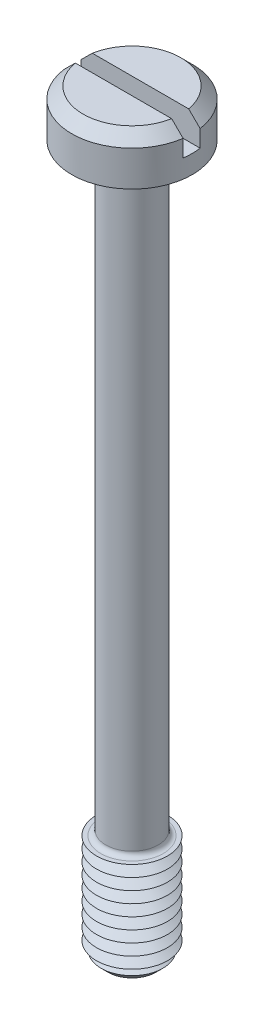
ISO-10303-21;
HEADER;
FILE_DESCRIPTION(('STEP AP214'),'2;1');
FILE_NAME('part.step','',(''),(''),'','','');
FILE_SCHEMA(('AUTOMOTIVE_DESIGN { 1 0 10303 214 1 1 1 1 }'));
ENDSEC;
DATA;
#1=APPLICATION_CONTEXT('core data for automotive mechanical design processes');
#2=APPLICATION_PROTOCOL_DEFINITION('international standard','automotive_design',2000,#1);
#3=PRODUCT_CONTEXT('',#1,'mechanical');
#4=PRODUCT('Part','Part','',(#3));
#5=PRODUCT_RELATED_PRODUCT_CATEGORY('part','',(#4));
#6=PRODUCT_DEFINITION_FORMATION('','',#4);
#7=PRODUCT_DEFINITION_CONTEXT('part definition',#1,'design');
#8=PRODUCT_DEFINITION('design','',#6,#7);
#9=PRODUCT_DEFINITION_SHAPE('','',#8);
#10=(LENGTH_UNIT() NAMED_UNIT(*) SI_UNIT(.MILLI.,.METRE.));
#11=(NAMED_UNIT(*) PLANE_ANGLE_UNIT() SI_UNIT($,.RADIAN.));
#12=(NAMED_UNIT(*) SI_UNIT($,.STERADIAN.) SOLID_ANGLE_UNIT());
#13=UNCERTAINTY_MEASURE_WITH_UNIT(LENGTH_MEASURE(1.E-05),#10,'distance_accuracy_value','');
#14=(GEOMETRIC_REPRESENTATION_CONTEXT(3) GLOBAL_UNCERTAINTY_ASSIGNED_CONTEXT((#13)) GLOBAL_UNIT_ASSIGNED_CONTEXT((#10,
#11,#12)) REPRESENTATION_CONTEXT('',''));
#15=CARTESIAN_POINT('',(0.,0.,0.));
#16=DIRECTION('',(0.,0.,1.));
#17=DIRECTION('',(1.,0.,0.));
#18=AXIS2_PLACEMENT_3D('',#15,#16,#17);
#19=CARTESIAN_POINT('',(0.,3.3,0.));
#20=DIRECTION('',(0.,1.,0.));
#21=DIRECTION('',(0.,0.,1.));
#22=AXIS2_PLACEMENT_3D('',#19,#20,#21);
#23=PLANE('',#22);
#24=DIRECTION('',(-1.,0.,0.));
#25=VECTOR('',#24,1.);
#26=CARTESIAN_POINT('',(4.25,3.3,-0.6));
#27=LINE('',#26,#25);
#28=CARTESIAN_POINT('',(3.39742549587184,3.3,-0.6));
#29=VERTEX_POINT('',#28);
#30=CARTESIAN_POINT('',(-3.39742549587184,3.3,-0.6));
#31=VERTEX_POINT('',#30);
#32=EDGE_CURVE('E110',#29,#31,#27,.T.);
#33=ORIENTED_EDGE('',*,*,#32,.F.);
#34=CARTESIAN_POINT('',(0.,3.3,0.));
#35=DIRECTION('',(0.,1.,0.));
#36=DIRECTION('',(0.,0.,1.));
#37=AXIS2_PLACEMENT_3D('',#34,#35,#36);
#38=CIRCLE('',#37,3.45);
#39=EDGE_CURVE('E113',#29,#31,#38,.T.);
#40=ORIENTED_EDGE('',*,*,#39,.T.);
#41=EDGE_LOOP('',(#33,#40));
#42=FACE_BOUND('',#41,.T.);
#43=ADVANCED_FACE('F39',(#42),#23,.T.);
#44=CARTESIAN_POINT('',(0.,3.3,0.));
#45=DIRECTION('',(0.,-1.,0.));
#46=DIRECTION('',(0.,0.,-1.));
#47=AXIS2_PLACEMENT_3D('',#44,#45,#46);
#48=CONICAL_SURFACE('',#47,3.45,0.785398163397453);
#49=CARTESIAN_POINT('',(9.3535140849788,-2.62273843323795,-0.6));
#50=CARTESIAN_POINT('',(9.03263557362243,-2.30252317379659,-0.6));
#51=CARTESIAN_POINT('',(8.71172811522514,-1.9823369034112,-0.6));
#52=CARTESIAN_POINT('',(8.06981262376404,-1.34205341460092,-0.6));
#53=CARTESIAN_POINT('',(7.74880458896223,-1.02195619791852,-0.6));
#54=CARTESIAN_POINT('',(7.10652460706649,-0.38176164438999,-0.6));
#55=CARTESIAN_POINT('',(6.78525260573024,-0.0616643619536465,-0.6));
#56=CARTESIAN_POINT('',(6.14251393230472,0.578323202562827,-0.6));
#57=CARTESIAN_POINT('',(5.8210472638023,0.898213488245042,-0.6));
#58=CARTESIAN_POINT('',(5.17196209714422,1.54347500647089,-0.6));
#59=CARTESIAN_POINT('',(4.84433778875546,1.86884039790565,-0.6));
#60=CARTESIAN_POINT('',(4.3524444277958,2.35644593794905,-0.6));
#61=CARTESIAN_POINT('',(4.18839924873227,2.51891187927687,-0.6));
#62=CARTESIAN_POINT('',(3.8600960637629,2.84362679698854,-0.6));
#63=CARTESIAN_POINT('',(3.69583805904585,3.00587577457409,-0.6));
#64=CARTESIAN_POINT('',(3.36705354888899,3.33001661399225,-0.6));
#65=CARTESIAN_POINT('',(3.20252712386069,3.49190855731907,-0.6));
#66=CARTESIAN_POINT('',(2.87298689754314,3.81520272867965,-0.6));
#67=CARTESIAN_POINT('',(2.70797308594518,3.97660494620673,-0.6));
#68=CARTESIAN_POINT('',(2.37716903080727,4.29858210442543,-0.6));
#69=CARTESIAN_POINT('',(2.2113788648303,4.45915712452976,-0.6));
#70=CARTESIAN_POINT('',(1.96157219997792,4.69884609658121,-0.6));
#71=CARTESIAN_POINT('',(1.8781178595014,4.77854546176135,-0.6));
#72=CARTESIAN_POINT('',(1.71066064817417,4.93736532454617,-0.6));
#73=CARTESIAN_POINT('',(1.6266577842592,5.01648582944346,-0.6));
#74=CARTESIAN_POINT('',(1.49655488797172,5.13773269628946,-0.6));
#75=CARTESIAN_POINT('',(1.45074972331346,5.1801752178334,-0.6));
#76=CARTESIAN_POINT('',(1.3588211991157,5.26471614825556,-0.6));
#77=CARTESIAN_POINT('',(1.31269783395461,5.30681455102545,-0.6));
#78=CARTESIAN_POINT('',(1.22008852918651,5.39050695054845,-0.6));
#79=CARTESIAN_POINT('',(1.17360305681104,5.4321014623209,-0.6));
#80=CARTESIAN_POINT('',(1.08007401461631,5.51465347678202,-0.6));
#81=CARTESIAN_POINT('',(1.03303046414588,5.55561100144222,-0.6));
#82=CARTESIAN_POINT('',(0.919047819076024,5.65299331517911,-0.6));
#83=CARTESIAN_POINT('',(0.851738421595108,5.70899242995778,-0.6));
#84=CARTESIAN_POINT('',(0.748806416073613,5.79068526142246,-0.6));
#85=CARTESIAN_POINT('',(0.714125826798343,5.81756213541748,-0.6));
#86=CARTESIAN_POINT('',(0.643915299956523,5.87018079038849,-0.6));
#87=CARTESIAN_POINT('',(0.608385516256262,5.89592277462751,-0.6));
#88=CARTESIAN_POINT('',(0.545162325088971,5.93955652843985,-0.6));
#89=CARTESIAN_POINT('',(0.517718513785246,5.95780799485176,-0.6));
#90=CARTESIAN_POINT('',(0.462025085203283,5.99303174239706,-0.6));
#91=CARTESIAN_POINT('',(0.433775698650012,6.01000438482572,-0.6));
#92=CARTESIAN_POINT('',(0.3763419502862,6.0421383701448,-0.6));
#93=CARTESIAN_POINT('',(0.347160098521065,6.05730412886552,-0.6));
#94=CARTESIAN_POINT('',(0.287642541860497,6.08513394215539,-0.6));
#95=CARTESIAN_POINT('',(0.25730803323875,6.09780051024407,-0.6));
#96=CARTESIAN_POINT('',(0.190863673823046,6.12124627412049,-0.6));
#97=CARTESIAN_POINT('',(0.154554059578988,6.13148571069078,-0.6));
#98=CARTESIAN_POINT('',(0.0807909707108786,6.14565404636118,-0.6));
#99=CARTESIAN_POINT('',(0.0433423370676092,6.14960664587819,-0.6));
#100=CARTESIAN_POINT('',(-0.03179874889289,6.15033783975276,-0.6));
#101=CARTESIAN_POINT('',(-0.0694915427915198,6.14708428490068,-0.6));
#102=CARTESIAN_POINT('',(-0.143790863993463,6.13410921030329,-0.6));
#103=CARTESIAN_POINT('',(-0.180393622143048,6.12436747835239,-0.6));
#104=CARTESIAN_POINT('',(-0.254098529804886,6.09939647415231,-0.6));
#105=CARTESIAN_POINT('',(-0.291094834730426,6.08386859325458,-0.6));
#106=CARTESIAN_POINT('',(-0.363408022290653,6.04924663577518,-0.6));
#107=CARTESIAN_POINT('',(-0.398721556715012,6.03014579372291,-0.6));
#108=CARTESIAN_POINT('',(-0.468234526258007,5.98944452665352,-0.6));
#109=CARTESIAN_POINT('',(-0.502422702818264,5.96782521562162,-0.6));
#110=CARTESIAN_POINT('',(-0.569689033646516,5.92300618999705,-0.6));
#111=CARTESIAN_POINT('',(-0.602768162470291,5.89980792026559,-0.6));
#112=CARTESIAN_POINT('',(-0.67114821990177,5.85008963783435,-0.6));
#113=CARTESIAN_POINT('',(-0.706369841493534,5.82346130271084,-0.6));
#114=CARTESIAN_POINT('',(-0.776087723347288,5.76926828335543,-0.6));
#115=CARTESIAN_POINT('',(-0.810583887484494,5.74170347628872,-0.6));
#116=CARTESIAN_POINT('',(-0.913286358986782,5.65798278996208,-0.6));
#117=CARTESIAN_POINT('',(-0.980673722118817,5.60082541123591,-0.6));
#118=CARTESIAN_POINT('',(-1.11424616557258,5.4849067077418,-0.6));
#119=CARTESIAN_POINT('',(-1.18042891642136,5.4261427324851,-0.6));
#120=CARTESIAN_POINT('',(-1.31191262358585,5.30767463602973,-0.6));
#121=CARTESIAN_POINT('',(-1.37721382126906,5.24797078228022,-0.6));
#122=CARTESIAN_POINT('',(-1.5070108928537,5.12812906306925,-0.6));
#123=CARTESIAN_POINT('',(-1.57150872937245,5.06799331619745,-0.6));
#124=CARTESIAN_POINT('',(-1.7000913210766,4.94727328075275,-0.6));
#125=CARTESIAN_POINT('',(-1.76417604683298,4.88668896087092,-0.6));
#126=CARTESIAN_POINT('',(-1.95584105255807,4.70458824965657,-0.6));
#127=CARTESIAN_POINT('',(-2.08296922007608,4.58259645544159,-0.6));
#128=CARTESIAN_POINT('',(-2.33599178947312,4.3384062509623,-0.6));
#129=CARTESIAN_POINT('',(-2.46188913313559,4.21621087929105,-0.6));
#130=CARTESIAN_POINT('',(-2.71323511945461,3.97135925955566,-0.6));
#131=CARTESIAN_POINT('',(-2.8386837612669,3.84870301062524,-0.6));
#132=CARTESIAN_POINT('',(-3.21459106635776,3.48027743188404,-0.6));
#133=CARTESIAN_POINT('',(-3.46460626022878,3.23405597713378,-0.6));
#134=CARTESIAN_POINT('',(-3.9641379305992,2.7409031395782,-0.6));
#135=CARTESIAN_POINT('',(-4.21365415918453,2.49397150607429,-0.6));
#136=CARTESIAN_POINT('',(-4.71232475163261,1.99974737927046,-0.6));
#137=CARTESIAN_POINT('',(-4.96147911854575,1.75245488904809,-0.6));
#138=CARTESIAN_POINT('',(-5.45958725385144,1.25761544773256,-0.6));
#139=CARTESIAN_POINT('',(-5.70854099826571,1.01006847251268,-0.6));
#140=CARTESIAN_POINT('',(-6.20629498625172,0.514819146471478,-0.6));
#141=CARTESIAN_POINT('',(-6.45509522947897,0.267116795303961,-0.6));
#142=CARTESIAN_POINT('',(-7.20128563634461,-0.476100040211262,-0.6));
#143=CARTESIAN_POINT('',(-7.69851620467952,-0.971774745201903,-0.6));
#144=CARTESIAN_POINT('',(-8.38865115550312,-1.66007026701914,-0.6));
#145=CARTESIAN_POINT('',(-8.58165346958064,-1.85259293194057,-0.6));
#146=CARTESIAN_POINT('',(-8.87112736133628,-2.14139225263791,-0.6));
#147=CARTESIAN_POINT('',(-8.96761014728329,-2.2376576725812,-0.6));
#148=CARTESIAN_POINT('',(-9.1605676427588,-2.43019387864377,-0.6));
#149=CARTESIAN_POINT('',(-9.25704235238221,-2.52646466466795,-0.6));
#150=CARTESIAN_POINT('',(-9.3535140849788,-2.62273843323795,-0.6));
#151=B_SPLINE_CURVE_WITH_KNOTS('',3,(#49,#50,#51,#52,#53,#54,#55,#56,#57,#58,#59,#60,#61,#62,
#63,#64,#65,#66,#67,#68,#69,#70,#71,#72,#73,#74,#75,#76,#77,#78,#79,#80,#81,#82,#83,#84,#85,#86,
#87,#88,#89,#90,#91,#92,#93,#94,#95,#96,#97,#98,#99,#100,#101,#102,#103,#104,#105,#106,#107,
#108,#109,#110,#111,#112,#113,#114,#115,#116,#117,#118,#119,#120,#121,#122,#123,#124,#125,#126,
#127,#128,#129,#130,#131,#132,#133,#134,#135,#136,#137,#138,#139,#140,#141,#142,#143,#144,#145,
#146,#147,#148,#149,#150),.UNSPECIFIED.,.F.,.F.,(4,2,2,2,2,2,2,2,2,2,2,2,2,2,2,2,2,2,2,2,2,2,2,
2,2,2,2,2,2,2,2,2,2,2,2,2,2,2,2,2,2,2,2,2,2,2,2,2,2,2,4),(0.,1.35996600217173,2.71995696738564,
4.08050889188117,5.44103646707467,6.82624457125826,7.51888721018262,8.21152599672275,
8.90398568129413,9.596460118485,10.288866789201,10.6350581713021,10.9812451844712,
11.1685812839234,11.3559207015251,11.5430489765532,11.7301707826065,11.9927784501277,
12.1243921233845,12.2559821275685,12.3548333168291,12.4536564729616,12.5522329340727,
12.6507097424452,12.763461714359,12.8757876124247,12.9886156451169,13.101796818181,
13.2218851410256,13.3422031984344,13.4634899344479,13.584667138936,13.7171086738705,
13.8495676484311,14.1146090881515,14.3801178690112,14.6455524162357,14.910099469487,
15.17466516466,15.7032346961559,16.2295761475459,16.7559185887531,17.8086237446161,
18.8617626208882,19.9148925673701,20.9681337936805,22.0213773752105,24.1276499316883,
24.9454725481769,25.354353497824,25.7632286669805),.UNSPECIFIED.);
#152=CARTESIAN_POINT('',(4.20743389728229,2.50000000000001,-0.6));
#153=VERTEX_POINT('',#152);
#154=EDGE_CURVE('E268',#153,#29,#151,.T.);
#155=ORIENTED_EDGE('',*,*,#154,.F.);
#156=CARTESIAN_POINT('',(0.,2.50000000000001,0.));
#157=DIRECTION('',(0.,1.,0.));
#158=DIRECTION('',(0.,0.,1.));
#159=AXIS2_PLACEMENT_3D('',#156,#157,#158);
#160=CIRCLE('',#159,4.25);
#161=CARTESIAN_POINT('',(-4.20743389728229,2.50000000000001,-0.6));
#162=VERTEX_POINT('',#161);
#163=EDGE_CURVE('E128',#162,#153,#160,.F.);
#164=ORIENTED_EDGE('',*,*,#163,.F.);
#165=EDGE_CURVE('E102',#31,#162,#151,.T.);
#166=ORIENTED_EDGE('',*,*,#165,.F.);
#167=ORIENTED_EDGE('',*,*,#39,.F.);
#168=EDGE_LOOP('',(#155,#164,#166,#167));
#169=FACE_BOUND('',#168,.T.);
#170=ADVANCED_FACE('F230',(#169),#48,.T.);
#171=CARTESIAN_POINT('',(0.,-50.,0.));
#172=DIRECTION('',(0.,1.,0.));
#173=DIRECTION('',(0.,0.,1.));
#174=AXIS2_PLACEMENT_3D('',#171,#172,#173);
#175=CYLINDRICAL_SURFACE('',#174,1.85);
#176=CARTESIAN_POINT('',(0.,-42.15,0.));
#177=DIRECTION('',(0.,-1.,0.));
#178=DIRECTION('',(0.,0.,-1.));
#179=AXIS2_PLACEMENT_3D('',#176,#177,#178);
#180=CIRCLE('',#179,1.85);
#181=CARTESIAN_POINT('',(0.,-42.15,-1.85));
#182=VERTEX_POINT('',#181);
#183=EDGE_CURVE('E123',#182,#182,#180,.F.);
#184=ORIENTED_EDGE('',*,*,#183,.T.);
#185=EDGE_LOOP('',(#184));
#186=FACE_BOUND('',#185,.T.);
#187=CARTESIAN_POINT('',(0.,-0.350000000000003,0.));
#188=DIRECTION('',(0.,1.,0.));
#189=DIRECTION('',(0.,0.,1.));
#190=AXIS2_PLACEMENT_3D('',#187,#188,#189);
#191=CIRCLE('',#190,1.85);
#192=CARTESIAN_POINT('',(0.,-0.350000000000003,1.85));
#193=VERTEX_POINT('',#192);
#194=EDGE_CURVE('E382',#193,#193,#191,.F.);
#195=ORIENTED_EDGE('',*,*,#194,.T.);
#196=EDGE_LOOP('',(#195));
#197=FACE_BOUND('',#196,.T.);
#198=ADVANCED_FACE('F226',(#186,#197),#175,.T.);
#199=CARTESIAN_POINT('',(0.,3.3,0.));
#200=DIRECTION('',(0.,-1.,0.));
#201=DIRECTION('',(0.,0.,-1.));
#202=AXIS2_PLACEMENT_3D('',#199,#200,#201);
#203=CYLINDRICAL_SURFACE('',#202,4.25);
#204=ORIENTED_EDGE('',*,*,#163,.T.);
#205=DIRECTION('',(0.,-1.,0.));
#206=VECTOR('',#205,1.);
#207=CARTESIAN_POINT('',(4.20743389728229,3.3,-0.6));
#208=LINE('',#207,#206);
#209=CARTESIAN_POINT('',(4.20743389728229,1.3,-0.6));
#210=VERTEX_POINT('',#209);
#211=EDGE_CURVE('E64',#153,#210,#208,.T.);
#212=ORIENTED_EDGE('',*,*,#211,.T.);
#213=CARTESIAN_POINT('',(0.,1.3,0.));
#214=DIRECTION('',(0.,1.,0.));
#215=DIRECTION('',(0.,0.,1.));
#216=AXIS2_PLACEMENT_3D('',#213,#214,#215);
#217=CIRCLE('',#216,4.25);
#218=CARTESIAN_POINT('',(4.20743389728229,1.3,0.6));
#219=VERTEX_POINT('',#218);
#220=EDGE_CURVE('E11',#219,#210,#217,.T.);
#221=ORIENTED_EDGE('',*,*,#220,.F.);
#222=DIRECTION('',(0.,-1.,0.));
#223=VECTOR('',#222,1.);
#224=CARTESIAN_POINT('',(4.20743389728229,3.3,0.6));
#225=LINE('',#224,#223);
#226=CARTESIAN_POINT('',(4.20743389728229,2.50000000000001,0.6));
#227=VERTEX_POINT('',#226);
#228=EDGE_CURVE('E283',#219,#227,#225,.F.);
#229=ORIENTED_EDGE('',*,*,#228,.T.);
#230=CARTESIAN_POINT('',(-4.20743389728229,2.50000000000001,0.6));
#231=VERTEX_POINT('',#230);
#232=EDGE_CURVE('E120',#227,#231,#160,.F.);
#233=ORIENTED_EDGE('',*,*,#232,.T.);
#234=DIRECTION('',(0.,-1.,0.));
#235=VECTOR('',#234,1.);
#236=CARTESIAN_POINT('',(-4.20743389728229,3.3,0.6));
#237=LINE('',#236,#235);
#238=CARTESIAN_POINT('',(-4.20743389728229,1.3,0.6));
#239=VERTEX_POINT('',#238);
#240=EDGE_CURVE('E96',#231,#239,#237,.T.);
#241=ORIENTED_EDGE('',*,*,#240,.T.);
#242=CARTESIAN_POINT('',(-4.20743389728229,1.3,-0.6));
#243=VERTEX_POINT('',#242);
#244=EDGE_CURVE('E44',#243,#239,#217,.T.);
#245=ORIENTED_EDGE('',*,*,#244,.F.);
#246=DIRECTION('',(0.,-1.,0.));
#247=VECTOR('',#246,1.);
#248=CARTESIAN_POINT('',(-4.20743389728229,3.3,-0.6));
#249=LINE('',#248,#247);
#250=EDGE_CURVE('E288',#243,#162,#249,.F.);
#251=ORIENTED_EDGE('',*,*,#250,.T.);
#252=EDGE_LOOP('',(#204,#212,#221,#229,#233,#241,#245,#251));
#253=FACE_BOUND('',#252,.T.);
#254=CARTESIAN_POINT('',(0.,0.,0.));
#255=DIRECTION('',(0.,1.,0.));
#256=DIRECTION('',(0.,0.,1.));
#257=AXIS2_PLACEMENT_3D('',#254,#255,#256);
#258=CIRCLE('',#257,4.25);
#259=CARTESIAN_POINT('',(0.,0.,4.25));
#260=VERTEX_POINT('',#259);
#261=EDGE_CURVE('E368',#260,#260,#258,.T.);
#262=ORIENTED_EDGE('',*,*,#261,.T.);
#263=EDGE_LOOP('',(#262));
#264=FACE_BOUND('',#263,.T.);
#265=ADVANCED_FACE('F229',(#253,#264),#203,.T.);
#266=DIRECTION('',(1.,0.,0.));
#267=VECTOR('',#266,1.);
#268=CARTESIAN_POINT('',(4.25,3.3,0.6));
#269=LINE('',#268,#267);
#270=CARTESIAN_POINT('',(-3.39742549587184,3.3,0.6));
#271=VERTEX_POINT('',#270);
#272=CARTESIAN_POINT('',(3.39742549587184,3.3,0.6));
#273=VERTEX_POINT('',#272);
#274=EDGE_CURVE('E56',#271,#273,#269,.T.);
#275=ORIENTED_EDGE('',*,*,#274,.F.);
#276=EDGE_CURVE('E108',#271,#273,#38,.T.);
#277=ORIENTED_EDGE('',*,*,#276,.T.);
#278=EDGE_LOOP('',(#275,#277));
#279=FACE_BOUND('',#278,.T.);
#280=ADVANCED_FACE('F107',(#279),#23,.T.);
#281=CARTESIAN_POINT('',(0.,0.,0.));
#282=DIRECTION('',(0.,1.,0.));
#283=DIRECTION('',(0.,0.,1.));
#284=AXIS2_PLACEMENT_3D('',#281,#282,#283);
#285=PLANE('',#284);
#286=CARTESIAN_POINT('',(0.,0.,0.));
#287=DIRECTION('',(0.,1.,0.));
#288=DIRECTION('',(0.,0.,1.));
#289=AXIS2_PLACEMENT_3D('',#286,#287,#288);
#290=CIRCLE('',#289,2.2);
#291=CARTESIAN_POINT('',(0.,0.,2.2));
#292=VERTEX_POINT('',#291);
#293=EDGE_CURVE('E114',#292,#292,#290,.T.);
#294=ORIENTED_EDGE('',*,*,#293,.T.);
#295=EDGE_LOOP('',(#294));
#296=FACE_BOUND('',#295,.T.);
#297=ORIENTED_EDGE('',*,*,#261,.F.);
#298=EDGE_LOOP('',(#297));
#299=FACE_BOUND('',#298,.T.);
#300=ADVANCED_FACE('F220',(#296,#299),#285,.F.);
#301=CARTESIAN_POINT('',(0.,-42.5,0.));
#302=DIRECTION('',(0.,-1.,0.));
#303=DIRECTION('',(0.,0.,-1.));
#304=AXIS2_PLACEMENT_3D('',#301,#302,#303);
#305=PLANE('',#304);
#306=CARTESIAN_POINT('',(0.,-42.5,0.));
#307=DIRECTION('',(0.,-1.,0.));
#308=DIRECTION('',(0.,0.,-1.));
#309=AXIS2_PLACEMENT_3D('',#306,#307,#308);
#310=CIRCLE('',#309,2.2);
#311=CARTESIAN_POINT('',(0.,-42.5,-2.2));
#312=VERTEX_POINT('',#311);
#313=EDGE_CURVE('E375',#312,#312,#310,.T.);
#314=ORIENTED_EDGE('',*,*,#313,.T.);
#315=EDGE_LOOP('',(#314));
#316=FACE_BOUND('',#315,.T.);
#317=CARTESIAN_POINT('',(0.,-42.5,0.));
#318=DIRECTION('',(0.,1.,0.));
#319=DIRECTION('',(0.,0.,1.));
#320=AXIS2_PLACEMENT_3D('',#317,#318,#319);
#321=CIRCLE('',#320,2.5);
#322=CARTESIAN_POINT('',(0.,-42.5,2.5));
#323=VERTEX_POINT('',#322);
#324=EDGE_CURVE('E365',#323,#323,#321,.T.);
#325=ORIENTED_EDGE('',*,*,#324,.T.);
#326=EDGE_LOOP('',(#325));
#327=FACE_BOUND('',#326,.T.);
#328=ADVANCED_FACE('F216',(#316,#327),#305,.F.);
#329=CARTESIAN_POINT('',(0.,-42.9,0.));
#330=DIRECTION('',(0.,1.,0.));
#331=DIRECTION('',(0.,0.,1.));
#332=AXIS2_PLACEMENT_3D('',#329,#330,#331);
#333=CONICAL_SURFACE('',#332,1.80717967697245,1.04719755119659);
#334=ORIENTED_EDGE('',*,*,#324,.F.);
#335=EDGE_LOOP('',(#334));
#336=FACE_BOUND('',#335,.T.);
#337=CARTESIAN_POINT('',(0.,-42.9,0.));
#338=DIRECTION('',(0.,1.,0.));
#339=DIRECTION('',(0.,0.,1.));
#340=AXIS2_PLACEMENT_3D('',#337,#338,#339);
#341=CIRCLE('',#340,1.80717967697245);
#342=CARTESIAN_POINT('',(0.,-42.9,1.80717967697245));
#343=VERTEX_POINT('',#342);
#344=EDGE_CURVE('E361',#343,#343,#341,.T.);
#345=ORIENTED_EDGE('',*,*,#344,.T.);
#346=EDGE_LOOP('',(#345));
#347=FACE_BOUND('',#346,.T.);
#348=ADVANCED_FACE('F212',(#336,#347),#333,.T.);
#349=CARTESIAN_POINT('',(0.,-43.3,0.));
#350=DIRECTION('',(0.,-1.,0.));
#351=DIRECTION('',(0.,0.,-1.));
#352=AXIS2_PLACEMENT_3D('',#349,#350,#351);
#353=CONICAL_SURFACE('',#352,2.5,1.0471975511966);
#354=ORIENTED_EDGE('',*,*,#344,.F.);
#355=EDGE_LOOP('',(#354));
#356=FACE_BOUND('',#355,.T.);
#357=CARTESIAN_POINT('',(0.,-43.3,0.));
#358=DIRECTION('',(0.,1.,0.));
#359=DIRECTION('',(0.,0.,1.));
#360=AXIS2_PLACEMENT_3D('',#357,#358,#359);
#361=CIRCLE('',#360,2.5);
#362=CARTESIAN_POINT('',(0.,-43.3,2.5));
#363=VERTEX_POINT('',#362);
#364=EDGE_CURVE('E357',#363,#363,#361,.T.);
#365=ORIENTED_EDGE('',*,*,#364,.T.);
#366=EDGE_LOOP('',(#365));
#367=FACE_BOUND('',#366,.T.);
#368=ADVANCED_FACE('F208',(#356,#367),#353,.T.);
#369=CARTESIAN_POINT('',(0.,-43.7,0.));
#370=DIRECTION('',(0.,1.,0.));
#371=DIRECTION('',(0.,0.,1.));
#372=AXIS2_PLACEMENT_3D('',#369,#370,#371);
#373=CONICAL_SURFACE('',#372,1.80717967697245,1.04719755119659);
#374=ORIENTED_EDGE('',*,*,#364,.F.);
#375=EDGE_LOOP('',(#374));
#376=FACE_BOUND('',#375,.T.);
#377=CARTESIAN_POINT('',(0.,-43.7,0.));
#378=DIRECTION('',(0.,1.,0.));
#379=DIRECTION('',(0.,0.,1.));
#380=AXIS2_PLACEMENT_3D('',#377,#378,#379);
#381=CIRCLE('',#380,1.80717967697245);
#382=CARTESIAN_POINT('',(0.,-43.7,1.80717967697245));
#383=VERTEX_POINT('',#382);
#384=EDGE_CURVE('E353',#383,#383,#381,.T.);
#385=ORIENTED_EDGE('',*,*,#384,.T.);
#386=EDGE_LOOP('',(#385));
#387=FACE_BOUND('',#386,.T.);
#388=ADVANCED_FACE('F204',(#376,#387),#373,.T.);
#389=CARTESIAN_POINT('',(0.,-44.1,0.));
#390=DIRECTION('',(0.,-1.,0.));
#391=DIRECTION('',(0.,0.,-1.));
#392=AXIS2_PLACEMENT_3D('',#389,#390,#391);
#393=CONICAL_SURFACE('',#392,2.5,1.0471975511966);
#394=ORIENTED_EDGE('',*,*,#384,.F.);
#395=EDGE_LOOP('',(#394));
#396=FACE_BOUND('',#395,.T.);
#397=CARTESIAN_POINT('',(0.,-44.1,0.));
#398=DIRECTION('',(0.,1.,0.));
#399=DIRECTION('',(0.,0.,1.));
#400=AXIS2_PLACEMENT_3D('',#397,#398,#399);
#401=CIRCLE('',#400,2.5);
#402=CARTESIAN_POINT('',(0.,-44.1,2.5));
#403=VERTEX_POINT('',#402);
#404=EDGE_CURVE('E350',#403,#403,#401,.T.);
#405=ORIENTED_EDGE('',*,*,#404,.T.);
#406=EDGE_LOOP('',(#405));
#407=FACE_BOUND('',#406,.T.);
#408=ADVANCED_FACE('F200',(#396,#407),#393,.T.);
#409=CARTESIAN_POINT('',(0.,-44.5,0.));
#410=DIRECTION('',(0.,1.,0.));
#411=DIRECTION('',(0.,0.,1.));
#412=AXIS2_PLACEMENT_3D('',#409,#410,#411);
#413=CONICAL_SURFACE('',#412,1.80717967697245,1.04719755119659);
#414=ORIENTED_EDGE('',*,*,#404,.F.);
#415=EDGE_LOOP('',(#414));
#416=FACE_BOUND('',#415,.T.);
#417=CARTESIAN_POINT('',(0.,-44.5,0.));
#418=DIRECTION('',(0.,1.,0.));
#419=DIRECTION('',(0.,0.,1.));
#420=AXIS2_PLACEMENT_3D('',#417,#418,#419);
#421=CIRCLE('',#420,1.80717967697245);
#422=CARTESIAN_POINT('',(0.,-44.5,1.80717967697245));
#423=VERTEX_POINT('',#422);
#424=EDGE_CURVE('E346',#423,#423,#421,.T.);
#425=ORIENTED_EDGE('',*,*,#424,.T.);
#426=EDGE_LOOP('',(#425));
#427=FACE_BOUND('',#426,.T.);
#428=ADVANCED_FACE('F196',(#416,#427),#413,.T.);
#429=CARTESIAN_POINT('',(0.,-44.9,0.));
#430=DIRECTION('',(0.,-1.,0.));
#431=DIRECTION('',(0.,0.,-1.));
#432=AXIS2_PLACEMENT_3D('',#429,#430,#431);
#433=CONICAL_SURFACE('',#432,2.5,1.0471975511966);
#434=ORIENTED_EDGE('',*,*,#424,.F.);
#435=EDGE_LOOP('',(#434));
#436=FACE_BOUND('',#435,.T.);
#437=CARTESIAN_POINT('',(0.,-44.9,0.));
#438=DIRECTION('',(0.,1.,0.));
#439=DIRECTION('',(0.,0.,1.));
#440=AXIS2_PLACEMENT_3D('',#437,#438,#439);
#441=CIRCLE('',#440,2.5);
#442=CARTESIAN_POINT('',(0.,-44.9,2.5));
#443=VERTEX_POINT('',#442);
#444=EDGE_CURVE('E342',#443,#443,#441,.T.);
#445=ORIENTED_EDGE('',*,*,#444,.T.);
#446=EDGE_LOOP('',(#445));
#447=FACE_BOUND('',#446,.T.);
#448=ADVANCED_FACE('F192',(#436,#447),#433,.T.);
#449=CARTESIAN_POINT('',(0.,-45.3,0.));
#450=DIRECTION('',(0.,1.,0.));
#451=DIRECTION('',(0.,0.,1.));
#452=AXIS2_PLACEMENT_3D('',#449,#450,#451);
#453=CONICAL_SURFACE('',#452,1.80717967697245,1.04719755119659);
#454=ORIENTED_EDGE('',*,*,#444,.F.);
#455=EDGE_LOOP('',(#454));
#456=FACE_BOUND('',#455,.T.);
#457=CARTESIAN_POINT('',(0.,-45.3,0.));
#458=DIRECTION('',(0.,1.,0.));
#459=DIRECTION('',(0.,0.,1.));
#460=AXIS2_PLACEMENT_3D('',#457,#458,#459);
#461=CIRCLE('',#460,1.80717967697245);
#462=CARTESIAN_POINT('',(0.,-45.3,1.80717967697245));
#463=VERTEX_POINT('',#462);
#464=EDGE_CURVE('E338',#463,#463,#461,.T.);
#465=ORIENTED_EDGE('',*,*,#464,.T.);
#466=EDGE_LOOP('',(#465));
#467=FACE_BOUND('',#466,.T.);
#468=ADVANCED_FACE('F188',(#456,#467),#453,.T.);
#469=CARTESIAN_POINT('',(0.,-45.7,0.));
#470=DIRECTION('',(0.,-1.,0.));
#471=DIRECTION('',(0.,0.,-1.));
#472=AXIS2_PLACEMENT_3D('',#469,#470,#471);
#473=CONICAL_SURFACE('',#472,2.5,1.0471975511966);
#474=ORIENTED_EDGE('',*,*,#464,.F.);
#475=EDGE_LOOP('',(#474));
#476=FACE_BOUND('',#475,.T.);
#477=CARTESIAN_POINT('',(0.,-45.7,0.));
#478=DIRECTION('',(0.,1.,0.));
#479=DIRECTION('',(0.,0.,1.));
#480=AXIS2_PLACEMENT_3D('',#477,#478,#479);
#481=CIRCLE('',#480,2.5);
#482=CARTESIAN_POINT('',(0.,-45.7,2.5));
#483=VERTEX_POINT('',#482);
#484=EDGE_CURVE('E334',#483,#483,#481,.T.);
#485=ORIENTED_EDGE('',*,*,#484,.T.);
#486=EDGE_LOOP('',(#485));
#487=FACE_BOUND('',#486,.T.);
#488=ADVANCED_FACE('F184',(#476,#487),#473,.T.);
#489=CARTESIAN_POINT('',(0.,-46.1,0.));
#490=DIRECTION('',(0.,1.,0.));
#491=DIRECTION('',(0.,0.,1.));
#492=AXIS2_PLACEMENT_3D('',#489,#490,#491);
#493=CONICAL_SURFACE('',#492,1.80717967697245,1.04719755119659);
#494=ORIENTED_EDGE('',*,*,#484,.F.);
#495=EDGE_LOOP('',(#494));
#496=FACE_BOUND('',#495,.T.);
#497=CARTESIAN_POINT('',(0.,-46.1,0.));
#498=DIRECTION('',(0.,1.,0.));
#499=DIRECTION('',(0.,0.,1.));
#500=AXIS2_PLACEMENT_3D('',#497,#498,#499);
#501=CIRCLE('',#500,1.80717967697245);
#502=CARTESIAN_POINT('',(0.,-46.1,1.80717967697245));
#503=VERTEX_POINT('',#502);
#504=EDGE_CURVE('E330',#503,#503,#501,.T.);
#505=ORIENTED_EDGE('',*,*,#504,.T.);
#506=EDGE_LOOP('',(#505));
#507=FACE_BOUND('',#506,.T.);
#508=ADVANCED_FACE('F180',(#496,#507),#493,.T.);
#509=CARTESIAN_POINT('',(0.,-46.5,0.));
#510=DIRECTION('',(0.,-1.,0.));
#511=DIRECTION('',(0.,0.,-1.));
#512=AXIS2_PLACEMENT_3D('',#509,#510,#511);
#513=CONICAL_SURFACE('',#512,2.5,1.0471975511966);
#514=ORIENTED_EDGE('',*,*,#504,.F.);
#515=EDGE_LOOP('',(#514));
#516=FACE_BOUND('',#515,.T.);
#517=CARTESIAN_POINT('',(0.,-46.5,0.));
#518=DIRECTION('',(0.,1.,0.));
#519=DIRECTION('',(0.,0.,1.));
#520=AXIS2_PLACEMENT_3D('',#517,#518,#519);
#521=CIRCLE('',#520,2.5);
#522=CARTESIAN_POINT('',(0.,-46.5,2.5));
#523=VERTEX_POINT('',#522);
#524=EDGE_CURVE('E326',#523,#523,#521,.T.);
#525=ORIENTED_EDGE('',*,*,#524,.T.);
#526=EDGE_LOOP('',(#525));
#527=FACE_BOUND('',#526,.T.);
#528=ADVANCED_FACE('F176',(#516,#527),#513,.T.);
#529=CARTESIAN_POINT('',(0.,-46.9,0.));
#530=DIRECTION('',(0.,1.,0.));
#531=DIRECTION('',(0.,0.,1.));
#532=AXIS2_PLACEMENT_3D('',#529,#530,#531);
#533=CONICAL_SURFACE('',#532,1.80717967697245,1.04719755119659);
#534=ORIENTED_EDGE('',*,*,#524,.F.);
#535=EDGE_LOOP('',(#534));
#536=FACE_BOUND('',#535,.T.);
#537=CARTESIAN_POINT('',(0.,-46.9,0.));
#538=DIRECTION('',(0.,1.,0.));
#539=DIRECTION('',(0.,0.,1.));
#540=AXIS2_PLACEMENT_3D('',#537,#538,#539);
#541=CIRCLE('',#540,1.80717967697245);
#542=CARTESIAN_POINT('',(0.,-46.9,1.80717967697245));
#543=VERTEX_POINT('',#542);
#544=EDGE_CURVE('E322',#543,#543,#541,.T.);
#545=ORIENTED_EDGE('',*,*,#544,.T.);
#546=EDGE_LOOP('',(#545));
#547=FACE_BOUND('',#546,.T.);
#548=ADVANCED_FACE('F172',(#536,#547),#533,.T.);
#549=CARTESIAN_POINT('',(0.,-47.3,0.));
#550=DIRECTION('',(0.,-1.,0.));
#551=DIRECTION('',(0.,0.,-1.));
#552=AXIS2_PLACEMENT_3D('',#549,#550,#551);
#553=CONICAL_SURFACE('',#552,2.5,1.0471975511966);
#554=ORIENTED_EDGE('',*,*,#544,.F.);
#555=EDGE_LOOP('',(#554));
#556=FACE_BOUND('',#555,.T.);
#557=CARTESIAN_POINT('',(0.,-47.3,0.));
#558=DIRECTION('',(0.,1.,0.));
#559=DIRECTION('',(0.,0.,1.));
#560=AXIS2_PLACEMENT_3D('',#557,#558,#559);
#561=CIRCLE('',#560,2.5);
#562=CARTESIAN_POINT('',(0.,-47.3,2.5));
#563=VERTEX_POINT('',#562);
#564=EDGE_CURVE('E319',#563,#563,#561,.T.);
#565=ORIENTED_EDGE('',*,*,#564,.T.);
#566=EDGE_LOOP('',(#565));
#567=FACE_BOUND('',#566,.T.);
#568=ADVANCED_FACE('F168',(#556,#567),#553,.T.);
#569=CARTESIAN_POINT('',(0.,-47.7,0.));
#570=DIRECTION('',(0.,1.,0.));
#571=DIRECTION('',(0.,0.,1.));
#572=AXIS2_PLACEMENT_3D('',#569,#570,#571);
#573=CONICAL_SURFACE('',#572,1.80717967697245,1.04719755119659);
#574=ORIENTED_EDGE('',*,*,#564,.F.);
#575=EDGE_LOOP('',(#574));
#576=FACE_BOUND('',#575,.T.);
#577=CARTESIAN_POINT('',(0.,-47.7,0.));
#578=DIRECTION('',(0.,1.,0.));
#579=DIRECTION('',(0.,0.,1.));
#580=AXIS2_PLACEMENT_3D('',#577,#578,#579);
#581=CIRCLE('',#580,1.80717967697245);
#582=CARTESIAN_POINT('',(0.,-47.7,1.80717967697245));
#583=VERTEX_POINT('',#582);
#584=EDGE_CURVE('E315',#583,#583,#581,.T.);
#585=ORIENTED_EDGE('',*,*,#584,.T.);
#586=EDGE_LOOP('',(#585));
#587=FACE_BOUND('',#586,.T.);
#588=ADVANCED_FACE('F164',(#576,#587),#573,.T.);
#589=CARTESIAN_POINT('',(0.,-48.1,0.));
#590=DIRECTION('',(0.,-1.,0.));
#591=DIRECTION('',(0.,0.,-1.));
#592=AXIS2_PLACEMENT_3D('',#589,#590,#591);
#593=CONICAL_SURFACE('',#592,2.5,1.0471975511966);
#594=ORIENTED_EDGE('',*,*,#584,.F.);
#595=EDGE_LOOP('',(#594));
#596=FACE_BOUND('',#595,.T.);
#597=CARTESIAN_POINT('',(0.,-48.1,0.));
#598=DIRECTION('',(0.,1.,0.));
#599=DIRECTION('',(0.,0.,1.));
#600=AXIS2_PLACEMENT_3D('',#597,#598,#599);
#601=CIRCLE('',#600,2.5);
#602=CARTESIAN_POINT('',(0.,-48.1,2.5));
#603=VERTEX_POINT('',#602);
#604=EDGE_CURVE('E311',#603,#603,#601,.T.);
#605=ORIENTED_EDGE('',*,*,#604,.T.);
#606=EDGE_LOOP('',(#605));
#607=FACE_BOUND('',#606,.T.);
#608=ADVANCED_FACE('F160',(#596,#607),#593,.T.);
#609=CARTESIAN_POINT('',(0.,-48.5,0.));
#610=DIRECTION('',(0.,1.,0.));
#611=DIRECTION('',(0.,0.,1.));
#612=AXIS2_PLACEMENT_3D('',#609,#610,#611);
#613=CONICAL_SURFACE('',#612,1.80717967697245,1.04719755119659);
#614=ORIENTED_EDGE('',*,*,#604,.F.);
#615=EDGE_LOOP('',(#614));
#616=FACE_BOUND('',#615,.T.);
#617=CARTESIAN_POINT('',(0.,-48.5,0.));
#618=DIRECTION('',(0.,1.,0.));
#619=DIRECTION('',(0.,0.,1.));
#620=AXIS2_PLACEMENT_3D('',#617,#618,#619);
#621=CIRCLE('',#620,1.80717967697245);
#622=CARTESIAN_POINT('',(0.,-48.5,1.80717967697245));
#623=VERTEX_POINT('',#622);
#624=EDGE_CURVE('E307',#623,#623,#621,.T.);
#625=ORIENTED_EDGE('',*,*,#624,.T.);
#626=EDGE_LOOP('',(#625));
#627=FACE_BOUND('',#626,.T.);
#628=ADVANCED_FACE('F156',(#616,#627),#613,.T.);
#629=CARTESIAN_POINT('',(0.,-48.9,0.));
#630=DIRECTION('',(0.,-1.,0.));
#631=DIRECTION('',(0.,0.,-1.));
#632=AXIS2_PLACEMENT_3D('',#629,#630,#631);
#633=CONICAL_SURFACE('',#632,2.5,1.0471975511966);
#634=ORIENTED_EDGE('',*,*,#624,.F.);
#635=EDGE_LOOP('',(#634));
#636=FACE_BOUND('',#635,.T.);
#637=CARTESIAN_POINT('',(0.,-48.9,0.));
#638=DIRECTION('',(0.,1.,0.));
#639=DIRECTION('',(0.,0.,1.));
#640=AXIS2_PLACEMENT_3D('',#637,#638,#639);
#641=CIRCLE('',#640,2.5);
#642=CARTESIAN_POINT('',(0.,-48.9,2.5));
#643=VERTEX_POINT('',#642);
#644=EDGE_CURVE('E302',#643,#643,#641,.T.);
#645=ORIENTED_EDGE('',*,*,#644,.T.);
#646=EDGE_LOOP('',(#645));
#647=FACE_BOUND('',#646,.T.);
#648=ADVANCED_FACE('F152',(#636,#647),#633,.T.);
#649=CARTESIAN_POINT('',(0.,-49.3,0.));
#650=DIRECTION('',(0.,1.,0.));
#651=DIRECTION('',(0.,0.,1.));
#652=AXIS2_PLACEMENT_3D('',#649,#650,#651);
#653=CONICAL_SURFACE('',#652,1.80717967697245,1.04719755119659);
#654=ORIENTED_EDGE('',*,*,#644,.F.);
#655=EDGE_LOOP('',(#654));
#656=FACE_BOUND('',#655,.T.);
#657=CARTESIAN_POINT('',(0.,-49.3,0.));
#658=DIRECTION('',(0.,1.,0.));
#659=DIRECTION('',(0.,0.,1.));
#660=AXIS2_PLACEMENT_3D('',#657,#658,#659);
#661=CIRCLE('',#660,1.80717967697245);
#662=CARTESIAN_POINT('',(0.,-49.3,1.80717967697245));
#663=VERTEX_POINT('',#662);
#664=EDGE_CURVE('E298',#663,#663,#661,.T.);
#665=ORIENTED_EDGE('',*,*,#664,.T.);
#666=EDGE_LOOP('',(#665));
#667=FACE_BOUND('',#666,.T.);
#668=ADVANCED_FACE('F148',(#656,#667),#653,.T.);
#669=CARTESIAN_POINT('',(0.,-49.7,0.));
#670=DIRECTION('',(0.,-1.,0.));
#671=DIRECTION('',(0.,0.,-1.));
#672=AXIS2_PLACEMENT_3D('',#669,#670,#671);
#673=CONICAL_SURFACE('',#672,2.5,1.0471975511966);
#674=CARTESIAN_POINT('',(0.,-49.5169872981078,0.));
#675=DIRECTION('',(0.,-1.,0.));
#676=DIRECTION('',(0.,0.,-1.));
#677=AXIS2_PLACEMENT_3D('',#674,#675,#676);
#678=CIRCLE('',#677,2.18301270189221);
#679=CARTESIAN_POINT('',(0.,-49.5169872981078,-2.18301270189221));
#680=VERTEX_POINT('',#679);
#681=EDGE_CURVE('E306',#680,#680,#678,.F.);
#682=ORIENTED_EDGE('',*,*,#681,.T.);
#683=EDGE_LOOP('',(#682));
#684=FACE_BOUND('',#683,.T.);
#685=ORIENTED_EDGE('',*,*,#664,.F.);
#686=EDGE_LOOP('',(#685));
#687=FACE_BOUND('',#686,.T.);
#688=ADVANCED_FACE('F144',(#684,#687),#673,.T.);
#689=CARTESIAN_POINT('',(0.,-50.,0.));
#690=DIRECTION('',(0.,-1.,0.));
#691=DIRECTION('',(0.,0.,-1.));
#692=AXIS2_PLACEMENT_3D('',#689,#690,#691);
#693=PLANE('',#692);
#694=CARTESIAN_POINT('',(0.,-50.,0.));
#695=DIRECTION('',(0.,-1.,0.));
#696=DIRECTION('',(0.,0.,-1.));
#697=AXIS2_PLACEMENT_3D('',#694,#695,#696);
#698=CIRCLE('',#697,1.69999999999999);
#699=CARTESIAN_POINT('',(0.,-50.,-1.69999999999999));
#700=VERTEX_POINT('',#699);
#701=EDGE_CURVE('E372',#700,#700,#698,.T.);
#702=ORIENTED_EDGE('',*,*,#701,.T.);
#703=EDGE_LOOP('',(#702));
#704=FACE_BOUND('',#703,.T.);
#705=ADVANCED_FACE('F147',(#704),#693,.T.);
#706=CARTESIAN_POINT('',(0.,-50.,0.));
#707=DIRECTION('',(0.,1.,0.));
#708=DIRECTION('',(0.,0.,1.));
#709=AXIS2_PLACEMENT_3D('',#706,#707,#708);
#710=CONICAL_SURFACE('',#709,1.69999999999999,0.785398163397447);
#711=ORIENTED_EDGE('',*,*,#681,.F.);
#712=EDGE_LOOP('',(#711));
#713=FACE_BOUND('',#712,.T.);
#714=ORIENTED_EDGE('',*,*,#701,.F.);
#715=EDGE_LOOP('',(#714));
#716=FACE_BOUND('',#715,.T.);
#717=ADVANCED_FACE('F224',(#713,#716),#710,.T.);
#718=CARTESIAN_POINT('',(0.,-42.15,0.));
#719=DIRECTION('',(0.,-1.,0.));
#720=DIRECTION('',(0.,0.,-1.));
#721=AXIS2_PLACEMENT_3D('',#718,#719,#720);
#722=TOROIDAL_SURFACE('',#721,2.2,0.35);
#723=ORIENTED_EDGE('',*,*,#183,.F.);
#724=EDGE_LOOP('',(#723));
#725=FACE_BOUND('',#724,.T.);
#726=ORIENTED_EDGE('',*,*,#313,.F.);
#727=EDGE_LOOP('',(#726));
#728=FACE_BOUND('',#727,.T.);
#729=ADVANCED_FACE('F242',(#725,#728),#722,.F.);
#730=CARTESIAN_POINT('',(0.,-0.350000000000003,0.));
#731=DIRECTION('',(0.,1.,0.));
#732=DIRECTION('',(0.,0.,1.));
#733=AXIS2_PLACEMENT_3D('',#730,#731,#732);
#734=TOROIDAL_SURFACE('',#733,2.2,0.35);
#735=ORIENTED_EDGE('',*,*,#293,.F.);
#736=EDGE_LOOP('',(#735));
#737=FACE_BOUND('',#736,.T.);
#738=ORIENTED_EDGE('',*,*,#194,.F.);
#739=EDGE_LOOP('',(#738));
#740=FACE_BOUND('',#739,.T.);
#741=ADVANCED_FACE('F245',(#737,#740),#734,.F.);
#742=CARTESIAN_POINT('',(-9.3535140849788,-2.62273843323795,0.6));
#743=CARTESIAN_POINT('',(-9.03263557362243,-2.30252317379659,0.6));
#744=CARTESIAN_POINT('',(-8.71172811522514,-1.9823369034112,0.6));
#745=CARTESIAN_POINT('',(-8.06981262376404,-1.34205341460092,0.6));
#746=CARTESIAN_POINT('',(-7.74880458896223,-1.02195619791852,0.6));
#747=CARTESIAN_POINT('',(-7.10652460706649,-0.38176164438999,0.6));
#748=CARTESIAN_POINT('',(-6.78525260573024,-0.0616643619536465,0.6));
#749=CARTESIAN_POINT('',(-6.14251393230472,0.578323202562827,0.6));
#750=CARTESIAN_POINT('',(-5.8210472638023,0.898213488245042,0.6));
#751=CARTESIAN_POINT('',(-5.17196209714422,1.54347500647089,0.6));
#752=CARTESIAN_POINT('',(-4.84433778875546,1.86884039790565,0.6));
#753=CARTESIAN_POINT('',(-4.3524444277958,2.35644593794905,0.6));
#754=CARTESIAN_POINT('',(-4.18839924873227,2.51891187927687,0.6));
#755=CARTESIAN_POINT('',(-3.8600960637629,2.84362679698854,0.6));
#756=CARTESIAN_POINT('',(-3.69583805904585,3.00587577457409,0.6));
#757=CARTESIAN_POINT('',(-3.36705354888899,3.33001661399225,0.6));
#758=CARTESIAN_POINT('',(-3.20252712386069,3.49190855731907,0.6));
#759=CARTESIAN_POINT('',(-2.87298689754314,3.81520272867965,0.6));
#760=CARTESIAN_POINT('',(-2.70797308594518,3.97660494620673,0.6));
#761=CARTESIAN_POINT('',(-2.37716903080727,4.29858210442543,0.6));
#762=CARTESIAN_POINT('',(-2.2113788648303,4.45915712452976,0.6));
#763=CARTESIAN_POINT('',(-1.96157219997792,4.69884609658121,0.6));
#764=CARTESIAN_POINT('',(-1.8781178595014,4.77854546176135,0.6));
#765=CARTESIAN_POINT('',(-1.71066064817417,4.93736532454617,0.6));
#766=CARTESIAN_POINT('',(-1.6266577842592,5.01648582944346,0.6));
#767=CARTESIAN_POINT('',(-1.49655488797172,5.13773269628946,0.6));
#768=CARTESIAN_POINT('',(-1.45074972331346,5.1801752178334,0.6));
#769=CARTESIAN_POINT('',(-1.3588211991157,5.26471614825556,0.6));
#770=CARTESIAN_POINT('',(-1.31269783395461,5.30681455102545,0.6));
#771=CARTESIAN_POINT('',(-1.22008852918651,5.39050695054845,0.6));
#772=CARTESIAN_POINT('',(-1.17360305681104,5.4321014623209,0.6));
#773=CARTESIAN_POINT('',(-1.08007401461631,5.51465347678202,0.6));
#774=CARTESIAN_POINT('',(-1.03303046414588,5.55561100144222,0.6));
#775=CARTESIAN_POINT('',(-0.919047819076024,5.65299331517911,0.6));
#776=CARTESIAN_POINT('',(-0.851738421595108,5.70899242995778,0.6));
#777=CARTESIAN_POINT('',(-0.748806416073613,5.79068526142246,0.6));
#778=CARTESIAN_POINT('',(-0.714125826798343,5.81756213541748,0.6));
#779=CARTESIAN_POINT('',(-0.643915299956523,5.87018079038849,0.6));
#780=CARTESIAN_POINT('',(-0.608385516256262,5.89592277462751,0.6));
#781=CARTESIAN_POINT('',(-0.545162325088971,5.93955652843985,0.6));
#782=CARTESIAN_POINT('',(-0.517718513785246,5.95780799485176,0.6));
#783=CARTESIAN_POINT('',(-0.462025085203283,5.99303174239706,0.6));
#784=CARTESIAN_POINT('',(-0.433775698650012,6.01000438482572,0.6));
#785=CARTESIAN_POINT('',(-0.3763419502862,6.0421383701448,0.6));
#786=CARTESIAN_POINT('',(-0.347160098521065,6.05730412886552,0.6));
#787=CARTESIAN_POINT('',(-0.287642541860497,6.08513394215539,0.6));
#788=CARTESIAN_POINT('',(-0.25730803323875,6.09780051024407,0.6));
#789=CARTESIAN_POINT('',(-0.190863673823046,6.12124627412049,0.6));
#790=CARTESIAN_POINT('',(-0.154554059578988,6.13148571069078,0.6));
#791=CARTESIAN_POINT('',(-0.0807909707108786,6.14565404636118,0.6));
#792=CARTESIAN_POINT('',(-0.0433423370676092,6.14960664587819,0.6));
#793=CARTESIAN_POINT('',(0.03179874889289,6.15033783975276,0.6));
#794=CARTESIAN_POINT('',(0.0694915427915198,6.14708428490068,0.6));
#795=CARTESIAN_POINT('',(0.143790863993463,6.13410921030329,0.6));
#796=CARTESIAN_POINT('',(0.180393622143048,6.12436747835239,0.6));
#797=CARTESIAN_POINT('',(0.254098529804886,6.09939647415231,0.6));
#798=CARTESIAN_POINT('',(0.291094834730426,6.08386859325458,0.6));
#799=CARTESIAN_POINT('',(0.363408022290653,6.04924663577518,0.6));
#800=CARTESIAN_POINT('',(0.398721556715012,6.03014579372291,0.6));
#801=CARTESIAN_POINT('',(0.468234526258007,5.98944452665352,0.6));
#802=CARTESIAN_POINT('',(0.502422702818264,5.96782521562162,0.6));
#803=CARTESIAN_POINT('',(0.569689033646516,5.92300618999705,0.6));
#804=CARTESIAN_POINT('',(0.602768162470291,5.89980792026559,0.6));
#805=CARTESIAN_POINT('',(0.67114821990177,5.85008963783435,0.6));
#806=CARTESIAN_POINT('',(0.706369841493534,5.82346130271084,0.6));
#807=CARTESIAN_POINT('',(0.776087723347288,5.76926828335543,0.6));
#808=CARTESIAN_POINT('',(0.810583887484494,5.74170347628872,0.6));
#809=CARTESIAN_POINT('',(0.913286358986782,5.65798278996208,0.6));
#810=CARTESIAN_POINT('',(0.980673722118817,5.60082541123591,0.6));
#811=CARTESIAN_POINT('',(1.11424616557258,5.4849067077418,0.6));
#812=CARTESIAN_POINT('',(1.18042891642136,5.4261427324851,0.6));
#813=CARTESIAN_POINT('',(1.31191262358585,5.30767463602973,0.6));
#814=CARTESIAN_POINT('',(1.37721382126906,5.24797078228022,0.6));
#815=CARTESIAN_POINT('',(1.5070108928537,5.12812906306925,0.6));
#816=CARTESIAN_POINT('',(1.57150872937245,5.06799331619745,0.6));
#817=CARTESIAN_POINT('',(1.7000913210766,4.94727328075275,0.6));
#818=CARTESIAN_POINT('',(1.76417604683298,4.88668896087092,0.6));
#819=CARTESIAN_POINT('',(1.95584105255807,4.70458824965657,0.6));
#820=CARTESIAN_POINT('',(2.08296922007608,4.58259645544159,0.6));
#821=CARTESIAN_POINT('',(2.33599178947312,4.3384062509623,0.6));
#822=CARTESIAN_POINT('',(2.46188913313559,4.21621087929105,0.6));
#823=CARTESIAN_POINT('',(2.71323511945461,3.97135925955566,0.6));
#824=CARTESIAN_POINT('',(2.8386837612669,3.84870301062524,0.6));
#825=CARTESIAN_POINT('',(3.21459106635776,3.48027743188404,0.6));
#826=CARTESIAN_POINT('',(3.46460626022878,3.23405597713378,0.6));
#827=CARTESIAN_POINT('',(3.9641379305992,2.7409031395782,0.6));
#828=CARTESIAN_POINT('',(4.21365415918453,2.49397150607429,0.6));
#829=CARTESIAN_POINT('',(4.71232475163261,1.99974737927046,0.6));
#830=CARTESIAN_POINT('',(4.96147911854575,1.75245488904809,0.6));
#831=CARTESIAN_POINT('',(5.45958725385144,1.25761544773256,0.6));
#832=CARTESIAN_POINT('',(5.70854099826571,1.01006847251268,0.6));
#833=CARTESIAN_POINT('',(6.20629498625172,0.514819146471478,0.6));
#834=CARTESIAN_POINT('',(6.45509522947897,0.267116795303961,0.6));
#835=CARTESIAN_POINT('',(7.20128563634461,-0.476100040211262,0.6));
#836=CARTESIAN_POINT('',(7.69851620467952,-0.971774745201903,0.6));
#837=CARTESIAN_POINT('',(8.38865115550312,-1.66007026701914,0.6));
#838=CARTESIAN_POINT('',(8.58165346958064,-1.85259293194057,0.6));
#839=CARTESIAN_POINT('',(8.87112736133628,-2.14139225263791,0.6));
#840=CARTESIAN_POINT('',(8.96761014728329,-2.2376576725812,0.6));
#841=CARTESIAN_POINT('',(9.1605676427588,-2.43019387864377,0.6));
#842=CARTESIAN_POINT('',(9.25704235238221,-2.52646466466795,0.6));
#843=CARTESIAN_POINT('',(9.3535140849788,-2.62273843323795,0.6));
#844=B_SPLINE_CURVE_WITH_KNOTS('',3,(#742,#743,#744,#745,#746,#747,#748,#749,#750,#751,#752,
#753,#754,#755,#756,#757,#758,#759,#760,#761,#762,#763,#764,#765,#766,#767,#768,#769,#770,#771,
#772,#773,#774,#775,#776,#777,#778,#779,#780,#781,#782,#783,#784,#785,#786,#787,#788,#789,#790,
#791,#792,#793,#794,#795,#796,#797,#798,#799,#800,#801,#802,#803,#804,#805,#806,#807,#808,#809,
#810,#811,#812,#813,#814,#815,#816,#817,#818,#819,#820,#821,#822,#823,#824,#825,#826,#827,#828,
#829,#830,#831,#832,#833,#834,#835,#836,#837,#838,#839,#840,#841,#842,#843),.UNSPECIFIED.,.F.,
.F.,(4,2,2,2,2,2,2,2,2,2,2,2,2,2,2,2,2,2,2,2,2,2,2,2,2,2,2,2,2,2,2,2,2,2,2,2,2,2,2,2,2,2,2,2,2,
2,2,2,2,2,4),(0.,1.35996600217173,2.71995696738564,4.08050889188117,5.44103646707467,
6.82624457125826,7.51888721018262,8.21152599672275,8.90398568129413,9.596460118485,
10.288866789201,10.6350581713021,10.9812451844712,11.1685812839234,11.3559207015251,
11.5430489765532,11.7301707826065,11.9927784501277,12.1243921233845,12.2559821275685,
12.3548333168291,12.4536564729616,12.5522329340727,12.6507097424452,12.763461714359,
12.8757876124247,12.9886156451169,13.101796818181,13.2218851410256,13.3422031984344,
13.4634899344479,13.584667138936,13.7171086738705,13.8495676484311,14.1146090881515,
14.3801178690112,14.6455524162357,14.910099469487,15.17466516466,15.7032346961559,
16.2295761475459,16.7559185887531,17.8086237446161,18.8617626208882,19.9148925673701,
20.9681337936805,22.0213773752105,24.1276499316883,24.9454725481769,25.354353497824,
25.7632286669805),.UNSPECIFIED.);
#845=EDGE_CURVE('E92',#231,#271,#844,.T.);
#846=ORIENTED_EDGE('',*,*,#845,.F.);
#847=ORIENTED_EDGE('',*,*,#232,.F.);
#848=EDGE_CURVE('E103',#273,#227,#844,.T.);
#849=ORIENTED_EDGE('',*,*,#848,.F.);
#850=ORIENTED_EDGE('',*,*,#276,.F.);
#851=EDGE_LOOP('',(#846,#847,#849,#850));
#852=FACE_BOUND('',#851,.T.);
#853=ADVANCED_FACE('F41',(#852),#48,.T.);
#854=CARTESIAN_POINT('',(0.,1.3,0.));
#855=DIRECTION('',(0.,1.,0.));
#856=DIRECTION('',(0.,0.,1.));
#857=AXIS2_PLACEMENT_3D('',#854,#855,#856);
#858=PLANE('',#857);
#859=DIRECTION('',(1.,0.,0.));
#860=VECTOR('',#859,1.);
#861=CARTESIAN_POINT('',(4.25,1.3,0.6));
#862=LINE('',#861,#860);
#863=EDGE_CURVE('E265',#239,#219,#862,.T.);
#864=ORIENTED_EDGE('',*,*,#863,.T.);
#865=ORIENTED_EDGE('',*,*,#220,.T.);
#866=DIRECTION('',(-1.,0.,0.));
#867=VECTOR('',#866,1.);
#868=CARTESIAN_POINT('',(4.25,1.3,-0.6));
#869=LINE('',#868,#867);
#870=EDGE_CURVE('E280',#210,#243,#869,.T.);
#871=ORIENTED_EDGE('',*,*,#870,.T.);
#872=ORIENTED_EDGE('',*,*,#244,.T.);
#873=EDGE_LOOP('',(#864,#865,#871,#872));
#874=FACE_BOUND('',#873,.T.);
#875=ADVANCED_FACE('F252',(#874),#858,.T.);
#876=CARTESIAN_POINT('',(4.25,1.3,-0.6));
#877=DIRECTION('',(0.,0.,-1.));
#878=DIRECTION('',(-1.,0.,0.));
#879=AXIS2_PLACEMENT_3D('',#876,#877,#878);
#880=PLANE('',#879);
#881=ORIENTED_EDGE('',*,*,#154,.T.);
#882=ORIENTED_EDGE('',*,*,#32,.T.);
#883=ORIENTED_EDGE('',*,*,#165,.T.);
#884=ORIENTED_EDGE('',*,*,#250,.F.);
#885=ORIENTED_EDGE('',*,*,#870,.F.);
#886=ORIENTED_EDGE('',*,*,#211,.F.);
#887=EDGE_LOOP('',(#881,#882,#883,#884,#885,#886));
#888=FACE_BOUND('',#887,.T.);
#889=ADVANCED_FACE('F141',(#888),#880,.F.);
#890=CARTESIAN_POINT('',(4.25,1.3,0.6));
#891=DIRECTION('',(0.,0.,1.));
#892=DIRECTION('',(1.,0.,0.));
#893=AXIS2_PLACEMENT_3D('',#890,#891,#892);
#894=PLANE('',#893);
#895=ORIENTED_EDGE('',*,*,#845,.T.);
#896=ORIENTED_EDGE('',*,*,#274,.T.);
#897=ORIENTED_EDGE('',*,*,#848,.T.);
#898=ORIENTED_EDGE('',*,*,#228,.F.);
#899=ORIENTED_EDGE('',*,*,#863,.F.);
#900=ORIENTED_EDGE('',*,*,#240,.F.);
#901=EDGE_LOOP('',(#895,#896,#897,#898,#899,#900));
#902=FACE_BOUND('',#901,.T.);
#903=ADVANCED_FACE('F93',(#902),#894,.F.);
#904=CLOSED_SHELL('',(#43,#170,#198,#265,#280,#300,#328,#348,#368,#388,#408,#428,#448,#468,#488,
#508,#528,#548,#568,#588,#608,#628,#648,#668,#688,#705,#717,#729,#741,#853,#875,#889,#903));
#905=MANIFOLD_SOLID_BREP('B2',#904);
#906=ADVANCED_BREP_SHAPE_REPRESENTATION('',(#18,#905),#14);
#907=SHAPE_DEFINITION_REPRESENTATION(#9,#906);
ENDSEC;
END-ISO-10303-21;
